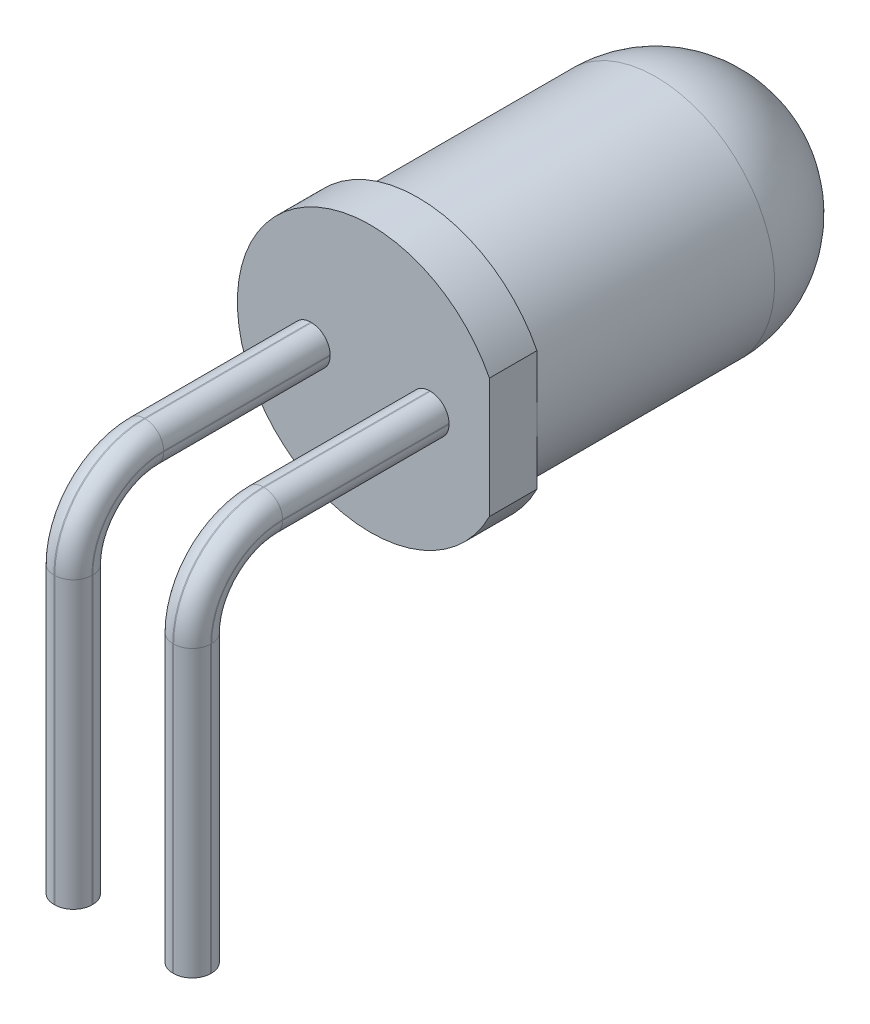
ISO-10303-21;
HEADER;
FILE_DESCRIPTION(('STEP AP214'),'2;1');
FILE_NAME('part.step','',(''),(''),'','','');
FILE_SCHEMA(('AUTOMOTIVE_DESIGN { 1 0 10303 214 1 1 1 1 }'));
ENDSEC;
DATA;
#1=APPLICATION_CONTEXT('core data for automotive mechanical design processes');
#2=APPLICATION_PROTOCOL_DEFINITION('international standard','automotive_design',2000,#1);
#3=PRODUCT_CONTEXT('',#1,'mechanical');
#4=PRODUCT('Part','Part','',(#3));
#5=PRODUCT_RELATED_PRODUCT_CATEGORY('part','',(#4));
#6=PRODUCT_DEFINITION_FORMATION('','',#4);
#7=PRODUCT_DEFINITION_CONTEXT('part definition',#1,'design');
#8=PRODUCT_DEFINITION('design','',#6,#7);
#9=PRODUCT_DEFINITION_SHAPE('','',#8);
#10=(LENGTH_UNIT() NAMED_UNIT(*) SI_UNIT(.MILLI.,.METRE.));
#11=(NAMED_UNIT(*) PLANE_ANGLE_UNIT() SI_UNIT($,.RADIAN.));
#12=(NAMED_UNIT(*) SI_UNIT($,.STERADIAN.) SOLID_ANGLE_UNIT());
#13=UNCERTAINTY_MEASURE_WITH_UNIT(LENGTH_MEASURE(1.E-05),#10,'distance_accuracy_value','');
#14=(GEOMETRIC_REPRESENTATION_CONTEXT(3) GLOBAL_UNCERTAINTY_ASSIGNED_CONTEXT((#13)) GLOBAL_UNIT_ASSIGNED_CONTEXT((#10,
#11,#12)) REPRESENTATION_CONTEXT('',''));
#15=CARTESIAN_POINT('',(0.,0.,0.));
#16=DIRECTION('',(0.,0.,1.));
#17=DIRECTION('',(1.,0.,0.));
#18=AXIS2_PLACEMENT_3D('',#15,#16,#17);
#19=CARTESIAN_POINT('',(1.65,-1.50000032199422,11.9999992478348));
#20=DIRECTION('',(-1.,0.,0.));
#21=DIRECTION('',(0.,0.,1.));
#22=AXIS2_PLACEMENT_3D('',#19,#20,#21);
#23=CYLINDRICAL_SURFACE('',#22,1.10000032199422);
#24=DIRECTION('',(-1.,0.,0.));
#25=VECTOR('',#24,1.);
#26=CARTESIAN_POINT('',(1.65,-0.399999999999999,11.9999993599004));
#27=LINE('',#26,#25);
#28=CARTESIAN_POINT('',(-1.24,-0.399999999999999,11.9999993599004));
#29=VERTEX_POINT('',#28);
#30=CARTESIAN_POINT('',(-1.26,-0.399999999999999,11.9999993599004));
#31=VERTEX_POINT('',#30);
#32=EDGE_CURVE('E489',#29,#31,#27,.T.);
#33=ORIENTED_EDGE('',*,*,#32,.F.);
#34=CARTESIAN_POINT('',(-1.24,-1.50000032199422,11.9999992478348));
#35=DIRECTION('',(1.,0.,0.));
#36=DIRECTION('',(0.,0.,-1.));
#37=AXIS2_PLACEMENT_3D('',#34,#35,#36);
#38=CIRCLE('',#37,1.10000032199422);
#39=CARTESIAN_POINT('',(-1.24,-1.50434905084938,13.0999909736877));
#40=VERTEX_POINT('',#39);
#41=EDGE_CURVE('E376',#29,#40,#38,.T.);
#42=ORIENTED_EDGE('',*,*,#41,.T.);
#43=DIRECTION('',(-1.,0.,0.));
#44=VECTOR('',#43,1.);
#45=CARTESIAN_POINT('',(1.65,-1.50434905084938,13.0999909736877));
#46=LINE('',#45,#44);
#47=CARTESIAN_POINT('',(-1.26,-1.50434905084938,13.0999909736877));
#48=VERTEX_POINT('',#47);
#49=EDGE_CURVE('E464',#40,#48,#46,.T.);
#50=ORIENTED_EDGE('',*,*,#49,.T.);
#51=CARTESIAN_POINT('',(-1.26,-1.50000032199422,11.9999992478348));
#52=DIRECTION('',(1.,0.,0.));
#53=DIRECTION('',(0.,0.,-1.));
#54=AXIS2_PLACEMENT_3D('',#51,#52,#53);
#55=CIRCLE('',#54,1.10000032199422);
#56=EDGE_CURVE('E374',#48,#31,#55,.F.);
#57=ORIENTED_EDGE('',*,*,#56,.T.);
#58=EDGE_LOOP('',(#33,#42,#50,#57));
#59=FACE_BOUND('',#58,.T.);
#60=ADVANCED_FACE('F26',(#59),#23,.F.);
#61=CARTESIAN_POINT('',(1.26,-1.50434905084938,13.0999909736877));
#62=VERTEX_POINT('',#61);
#63=CARTESIAN_POINT('',(1.24,-1.50434905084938,13.0999909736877));
#64=VERTEX_POINT('',#63);
#65=EDGE_CURVE('E468',#62,#64,#46,.T.);
#66=ORIENTED_EDGE('',*,*,#65,.T.);
#67=CARTESIAN_POINT('',(1.24,-1.50000032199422,11.9999992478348));
#68=DIRECTION('',(-1.,0.,0.));
#69=DIRECTION('',(0.,0.,1.));
#70=AXIS2_PLACEMENT_3D('',#67,#68,#69);
#71=CIRCLE('',#70,1.10000032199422);
#72=CARTESIAN_POINT('',(1.24,-0.399999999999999,11.9999993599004));
#73=VERTEX_POINT('',#72);
#74=EDGE_CURVE('E380',#64,#73,#71,.T.);
#75=ORIENTED_EDGE('',*,*,#74,.T.);
#76=CARTESIAN_POINT('',(1.26,-0.399999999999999,11.9999993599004));
#77=VERTEX_POINT('',#76);
#78=EDGE_CURVE('E258',#77,#73,#27,.T.);
#79=ORIENTED_EDGE('',*,*,#78,.F.);
#80=CARTESIAN_POINT('',(1.26,-1.50000032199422,11.9999992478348));
#81=DIRECTION('',(1.,0.,0.));
#82=DIRECTION('',(0.,0.,-1.));
#83=AXIS2_PLACEMENT_3D('',#80,#81,#82);
#84=CIRCLE('',#83,1.10000032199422);
#85=EDGE_CURVE('E378',#77,#62,#84,.T.);
#86=ORIENTED_EDGE('',*,*,#85,.T.);
#87=EDGE_LOOP('',(#66,#75,#79,#86));
#88=FACE_BOUND('',#87,.T.);
#89=ADVANCED_FACE('F619',(#88),#23,.F.);
#90=CARTESIAN_POINT('',(1.65,-0.4,8.4544798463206));
#91=DIRECTION('',(0.,1.,0.));
#92=DIRECTION('',(0.,0.,1.));
#93=AXIS2_PLACEMENT_3D('',#90,#91,#92);
#94=PLANE('',#93);
#95=DIRECTION('',(-1.,0.,0.));
#96=VECTOR('',#95,1.);
#97=CARTESIAN_POINT('',(0.,-0.4,8.5));
#98=LINE('',#97,#96);
#99=CARTESIAN_POINT('',(-1.24,-0.4,8.5));
#100=VERTEX_POINT('',#99);
#101=CARTESIAN_POINT('',(-1.26,-0.4,8.5));
#102=VERTEX_POINT('',#101);
#103=EDGE_CURVE('E296',#100,#102,#98,.T.);
#104=ORIENTED_EDGE('',*,*,#103,.F.);
#105=DIRECTION('',(0.,0.,-1.));
#106=VECTOR('',#105,1.);
#107=CARTESIAN_POINT('',(-1.24,-0.399999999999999,11.9999993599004));
#108=LINE('',#107,#106);
#109=EDGE_CURVE('E316',#100,#29,#108,.F.);
#110=ORIENTED_EDGE('',*,*,#109,.T.);
#111=ORIENTED_EDGE('',*,*,#32,.T.);
#112=DIRECTION('',(0.,0.,-1.));
#113=VECTOR('',#112,1.);
#114=CARTESIAN_POINT('',(-1.26,-0.4,8.4544798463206));
#115=LINE('',#114,#113);
#116=EDGE_CURVE('E313',#31,#102,#115,.T.);
#117=ORIENTED_EDGE('',*,*,#116,.T.);
#118=EDGE_LOOP('',(#104,#110,#111,#117));
#119=FACE_BOUND('',#118,.T.);
#120=ADVANCED_FACE('F499',(#119),#94,.F.);
#121=ORIENTED_EDGE('',*,*,#78,.T.);
#122=DIRECTION('',(0.,0.,1.));
#123=VECTOR('',#122,1.);
#124=CARTESIAN_POINT('',(1.24,-0.4,8.5));
#125=LINE('',#124,#123);
#126=CARTESIAN_POINT('',(1.24,-0.4,8.5));
#127=VERTEX_POINT('',#126);
#128=EDGE_CURVE('E346',#73,#127,#125,.F.);
#129=ORIENTED_EDGE('',*,*,#128,.T.);
#130=CARTESIAN_POINT('',(1.26,-0.4,8.5));
#131=VERTEX_POINT('',#130);
#132=EDGE_CURVE('E292',#131,#127,#98,.T.);
#133=ORIENTED_EDGE('',*,*,#132,.F.);
#134=DIRECTION('',(0.,0.,-1.));
#135=VECTOR('',#134,1.);
#136=CARTESIAN_POINT('',(1.26,-0.399999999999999,11.9999993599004));
#137=LINE('',#136,#135);
#138=EDGE_CURVE('E344',#131,#77,#137,.F.);
#139=ORIENTED_EDGE('',*,*,#138,.T.);
#140=EDGE_LOOP('',(#121,#129,#133,#139));
#141=FACE_BOUND('',#140,.T.);
#142=ADVANCED_FACE('F609',(#141),#94,.F.);
#143=CARTESIAN_POINT('',(1.65,0.4,8.4544798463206));
#144=DIRECTION('',(0.,-1.,0.));
#145=DIRECTION('',(0.,0.,-1.));
#146=AXIS2_PLACEMENT_3D('',#143,#144,#145);
#147=PLANE('',#146);
#148=DIRECTION('',(1.,0.,0.));
#149=VECTOR('',#148,1.);
#150=CARTESIAN_POINT('',(0.,0.400000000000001,8.5));
#151=LINE('',#150,#149);
#152=CARTESIAN_POINT('',(-1.26,0.400000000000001,8.5));
#153=VERTEX_POINT('',#152);
#154=CARTESIAN_POINT('',(-1.24,0.400000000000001,8.5));
#155=VERTEX_POINT('',#154);
#156=EDGE_CURVE('E291',#153,#155,#151,.T.);
#157=ORIENTED_EDGE('',*,*,#156,.F.);
#158=DIRECTION('',(0.,0.,1.));
#159=VECTOR('',#158,1.);
#160=CARTESIAN_POINT('',(-1.26,0.4,8.4544798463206));
#161=LINE('',#160,#159);
#162=CARTESIAN_POINT('',(-1.26,0.400000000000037,11.9999993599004));
#163=VERTEX_POINT('',#162);
#164=EDGE_CURVE('E384',#153,#163,#161,.T.);
#165=ORIENTED_EDGE('',*,*,#164,.T.);
#166=DIRECTION('',(-1.,0.,0.));
#167=VECTOR('',#166,1.);
#168=CARTESIAN_POINT('',(1.65,0.400000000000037,11.9999993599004));
#169=LINE('',#168,#167);
#170=CARTESIAN_POINT('',(-1.24,0.400000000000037,11.9999993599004));
#171=VERTEX_POINT('',#170);
#172=EDGE_CURVE('E485',#171,#163,#169,.T.);
#173=ORIENTED_EDGE('',*,*,#172,.F.);
#174=DIRECTION('',(0.,0.,1.));
#175=VECTOR('',#174,1.);
#176=CARTESIAN_POINT('',(-1.24,0.400000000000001,8.5));
#177=LINE('',#176,#175);
#178=EDGE_CURVE('E382',#171,#155,#177,.F.);
#179=ORIENTED_EDGE('',*,*,#178,.T.);
#180=EDGE_LOOP('',(#157,#165,#173,#179));
#181=FACE_BOUND('',#180,.T.);
#182=ADVANCED_FACE('F606',(#181),#147,.F.);
#183=CARTESIAN_POINT('',(1.24,0.400000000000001,8.5));
#184=VERTEX_POINT('',#183);
#185=CARTESIAN_POINT('',(1.26,0.400000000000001,8.5));
#186=VERTEX_POINT('',#185);
#187=EDGE_CURVE('E288',#184,#186,#151,.T.);
#188=ORIENTED_EDGE('',*,*,#187,.F.);
#189=DIRECTION('',(0.,0.,-1.));
#190=VECTOR('',#189,1.);
#191=CARTESIAN_POINT('',(1.24,0.400000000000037,11.9999993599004));
#192=LINE('',#191,#190);
#193=CARTESIAN_POINT('',(1.24,0.400000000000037,11.9999993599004));
#194=VERTEX_POINT('',#193);
#195=EDGE_CURVE('E393',#184,#194,#192,.F.);
#196=ORIENTED_EDGE('',*,*,#195,.T.);
#197=CARTESIAN_POINT('',(1.26,0.400000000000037,11.9999993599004));
#198=VERTEX_POINT('',#197);
#199=EDGE_CURVE('E487',#198,#194,#169,.T.);
#200=ORIENTED_EDGE('',*,*,#199,.F.);
#201=DIRECTION('',(0.,0.,1.));
#202=VECTOR('',#201,1.);
#203=CARTESIAN_POINT('',(1.26,0.400000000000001,8.5));
#204=LINE('',#203,#202);
#205=EDGE_CURVE('E391',#198,#186,#204,.F.);
#206=ORIENTED_EDGE('',*,*,#205,.T.);
#207=EDGE_LOOP('',(#188,#196,#200,#206));
#208=FACE_BOUND('',#207,.T.);
#209=ADVANCED_FACE('F608',(#208),#147,.F.);
#210=CARTESIAN_POINT('',(1.65,-1.50000032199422,11.9999992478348));
#211=DIRECTION('',(-1.,0.,0.));
#212=DIRECTION('',(0.,0.,1.));
#213=AXIS2_PLACEMENT_3D('',#210,#211,#212);
#214=CYLINDRICAL_SURFACE('',#213,1.90000032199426);
#215=ORIENTED_EDGE('',*,*,#172,.T.);
#216=CARTESIAN_POINT('',(-1.26,-1.50000032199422,11.9999992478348));
#217=DIRECTION('',(1.,0.,0.));
#218=DIRECTION('',(0.,0.,-1.));
#219=AXIS2_PLACEMENT_3D('',#216,#217,#218);
#220=CIRCLE('',#219,1.90000032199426);
#221=CARTESIAN_POINT('',(-1.26,-1.50289165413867,13.8999973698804));
#222=VERTEX_POINT('',#221);
#223=EDGE_CURVE('E389',#163,#222,#220,.T.);
#224=ORIENTED_EDGE('',*,*,#223,.T.);
#225=DIRECTION('',(-1.,0.,0.));
#226=VECTOR('',#225,1.);
#227=CARTESIAN_POINT('',(1.65,-1.50289165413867,13.8999973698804));
#228=LINE('',#227,#226);
#229=CARTESIAN_POINT('',(-1.24,-1.50289165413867,13.8999973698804));
#230=VERTEX_POINT('',#229);
#231=EDGE_CURVE('E486',#230,#222,#228,.T.);
#232=ORIENTED_EDGE('',*,*,#231,.F.);
#233=CARTESIAN_POINT('',(-1.24,-1.50000032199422,11.9999992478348));
#234=DIRECTION('',(1.,0.,0.));
#235=DIRECTION('',(0.,0.,-1.));
#236=AXIS2_PLACEMENT_3D('',#233,#234,#235);
#237=CIRCLE('',#236,1.90000032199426);
#238=EDGE_CURVE('E387',#230,#171,#237,.F.);
#239=ORIENTED_EDGE('',*,*,#238,.T.);
#240=EDGE_LOOP('',(#215,#224,#232,#239));
#241=FACE_BOUND('',#240,.T.);
#242=ADVANCED_FACE('F604',(#241),#214,.T.);
#243=ORIENTED_EDGE('',*,*,#199,.T.);
#244=CARTESIAN_POINT('',(1.24,-1.50000032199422,11.9999992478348));
#245=DIRECTION('',(-1.,0.,0.));
#246=DIRECTION('',(0.,0.,1.));
#247=AXIS2_PLACEMENT_3D('',#244,#245,#246);
#248=CIRCLE('',#247,1.90000032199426);
#249=CARTESIAN_POINT('',(1.24,-1.50289165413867,13.8999973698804));
#250=VERTEX_POINT('',#249);
#251=EDGE_CURVE('E397',#194,#250,#248,.F.);
#252=ORIENTED_EDGE('',*,*,#251,.T.);
#253=CARTESIAN_POINT('',(1.26,-1.50289165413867,13.8999973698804));
#254=VERTEX_POINT('',#253);
#255=EDGE_CURVE('E482',#254,#250,#228,.T.);
#256=ORIENTED_EDGE('',*,*,#255,.F.);
#257=CARTESIAN_POINT('',(1.26,-1.50000032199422,11.9999992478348));
#258=DIRECTION('',(1.,0.,0.));
#259=DIRECTION('',(0.,0.,-1.));
#260=AXIS2_PLACEMENT_3D('',#257,#258,#259);
#261=CIRCLE('',#260,1.90000032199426);
#262=EDGE_CURVE('E395',#254,#198,#261,.F.);
#263=ORIENTED_EDGE('',*,*,#262,.T.);
#264=EDGE_LOOP('',(#243,#252,#256,#263));
#265=FACE_BOUND('',#264,.T.);
#266=ADVANCED_FACE('F853',(#265),#214,.T.);
#267=CARTESIAN_POINT('',(1.65,-7.50434905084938,13.8999973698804));
#268=DIRECTION('',(0.,0.,-1.));
#269=DIRECTION('',(-1.,0.,0.));
#270=AXIS2_PLACEMENT_3D('',#267,#268,#269);
#271=PLANE('',#270);
#272=ORIENTED_EDGE('',*,*,#231,.T.);
#273=DIRECTION('',(0.,-1.,0.));
#274=VECTOR('',#273,1.);
#275=CARTESIAN_POINT('',(-1.26,-7.50434905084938,13.8999973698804));
#276=LINE('',#275,#274);
#277=CARTESIAN_POINT('',(-1.26,-7.50434905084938,13.8999973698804));
#278=VERTEX_POINT('',#277);
#279=EDGE_CURVE('E41',#222,#278,#276,.T.);
#280=ORIENTED_EDGE('',*,*,#279,.T.);
#281=DIRECTION('',(-1.,0.,0.));
#282=VECTOR('',#281,1.);
#283=CARTESIAN_POINT('',(1.65,-7.50434905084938,13.8999973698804));
#284=LINE('',#283,#282);
#285=CARTESIAN_POINT('',(-1.24,-7.50434905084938,13.8999973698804));
#286=VERTEX_POINT('',#285);
#287=EDGE_CURVE('E479',#286,#278,#284,.T.);
#288=ORIENTED_EDGE('',*,*,#287,.F.);
#289=DIRECTION('',(0.,-1.,0.));
#290=VECTOR('',#289,1.);
#291=CARTESIAN_POINT('',(-1.24,-1.50289165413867,13.8999973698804));
#292=LINE('',#291,#290);
#293=EDGE_CURVE('E414',#286,#230,#292,.F.);
#294=ORIENTED_EDGE('',*,*,#293,.T.);
#295=EDGE_LOOP('',(#272,#280,#288,#294));
#296=FACE_BOUND('',#295,.T.);
#297=ADVANCED_FACE('F851',(#296),#271,.F.);
#298=CARTESIAN_POINT('',(1.26,-7.50434905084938,13.8999973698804));
#299=VERTEX_POINT('',#298);
#300=CARTESIAN_POINT('',(1.24,-7.50434905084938,13.8999973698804));
#301=VERTEX_POINT('',#300);
#302=EDGE_CURVE('E481',#299,#301,#284,.T.);
#303=ORIENTED_EDGE('',*,*,#302,.F.);
#304=DIRECTION('',(0.,-1.,0.));
#305=VECTOR('',#304,1.);
#306=CARTESIAN_POINT('',(1.26,-1.50289165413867,13.8999973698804));
#307=LINE('',#306,#305);
#308=EDGE_CURVE('E401',#299,#254,#307,.F.);
#309=ORIENTED_EDGE('',*,*,#308,.T.);
#310=ORIENTED_EDGE('',*,*,#255,.T.);
#311=DIRECTION('',(0.,1.,0.));
#312=VECTOR('',#311,1.);
#313=CARTESIAN_POINT('',(1.24,-7.50434905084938,13.8999973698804));
#314=LINE('',#313,#312);
#315=EDGE_CURVE('E399',#250,#301,#314,.F.);
#316=ORIENTED_EDGE('',*,*,#315,.T.);
#317=EDGE_LOOP('',(#303,#309,#310,#316));
#318=FACE_BOUND('',#317,.T.);
#319=ADVANCED_FACE('F850',(#318),#271,.F.);
#320=CARTESIAN_POINT('',(1.65,-7.50434905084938,13.0999909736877));
#321=DIRECTION('',(0.,1.,0.));
#322=DIRECTION('',(0.,0.,1.));
#323=AXIS2_PLACEMENT_3D('',#320,#321,#322);
#324=PLANE('',#323);
#325=DIRECTION('',(-1.,0.,0.));
#326=VECTOR('',#325,1.);
#327=CARTESIAN_POINT('',(1.65,-7.50434905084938,13.0999909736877));
#328=LINE('',#327,#326);
#329=CARTESIAN_POINT('',(-1.24,-7.50434905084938,13.0999909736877));
#330=VERTEX_POINT('',#329);
#331=CARTESIAN_POINT('',(-1.26,-7.50434905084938,13.0999909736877));
#332=VERTEX_POINT('',#331);
#333=EDGE_CURVE('E475',#330,#332,#328,.T.);
#334=ORIENTED_EDGE('',*,*,#333,.F.);
#335=CARTESIAN_POINT('',(-1.24,-7.50434905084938,13.4899909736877));
#336=DIRECTION('',(0.,1.,0.));
#337=DIRECTION('',(0.,0.,1.));
#338=AXIS2_PLACEMENT_3D('',#335,#336,#337);
#339=CIRCLE('',#338,0.39);
#340=CARTESIAN_POINT('',(-0.85,-7.50434905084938,13.4899909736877));
#341=VERTEX_POINT('',#340);
#342=EDGE_CURVE('E412',#330,#341,#339,.F.);
#343=ORIENTED_EDGE('',*,*,#342,.T.);
#344=DIRECTION('',(0.,0.,-1.));
#345=VECTOR('',#344,1.);
#346=CARTESIAN_POINT('',(-0.85,-7.50434905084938,13.0999909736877));
#347=LINE('',#346,#345);
#348=CARTESIAN_POINT('',(-0.85,-7.50434905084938,13.5099973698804));
#349=VERTEX_POINT('',#348);
#350=EDGE_CURVE('E471',#349,#341,#347,.T.);
#351=ORIENTED_EDGE('',*,*,#350,.F.);
#352=CARTESIAN_POINT('',(-1.24,-7.50434905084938,13.5099973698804));
#353=DIRECTION('',(0.,1.,0.));
#354=DIRECTION('',(0.,0.,1.));
#355=AXIS2_PLACEMENT_3D('',#352,#353,#354);
#356=CIRCLE('',#355,0.39);
#357=EDGE_CURVE('E48',#349,#286,#356,.F.);
#358=ORIENTED_EDGE('',*,*,#357,.T.);
#359=ORIENTED_EDGE('',*,*,#287,.T.);
#360=CARTESIAN_POINT('',(-1.26,-7.50434905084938,13.5099973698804));
#361=DIRECTION('',(0.,1.,0.));
#362=DIRECTION('',(0.,0.,1.));
#363=AXIS2_PLACEMENT_3D('',#360,#361,#362);
#364=CIRCLE('',#363,0.39);
#365=CARTESIAN_POINT('',(-1.65,-7.50434905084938,13.5099973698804));
#366=VERTEX_POINT('',#365);
#367=EDGE_CURVE('E408',#278,#366,#364,.F.);
#368=ORIENTED_EDGE('',*,*,#367,.T.);
#369=DIRECTION('',(0.,0.,-1.));
#370=VECTOR('',#369,1.);
#371=CARTESIAN_POINT('',(-1.65,-7.50434905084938,13.0999909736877));
#372=LINE('',#371,#370);
#373=CARTESIAN_POINT('',(-1.65,-7.50434905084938,13.4899909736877));
#374=VERTEX_POINT('',#373);
#375=EDGE_CURVE('E465',#366,#374,#372,.T.);
#376=ORIENTED_EDGE('',*,*,#375,.T.);
#377=CARTESIAN_POINT('',(-1.26,-7.50434905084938,13.4899909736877));
#378=DIRECTION('',(0.,1.,0.));
#379=DIRECTION('',(0.,0.,1.));
#380=AXIS2_PLACEMENT_3D('',#377,#378,#379);
#381=CIRCLE('',#380,0.39);
#382=EDGE_CURVE('E410',#374,#332,#381,.F.);
#383=ORIENTED_EDGE('',*,*,#382,.T.);
#384=EDGE_LOOP('',(#334,#343,#351,#358,#359,#368,#376,#383));
#385=FACE_BOUND('',#384,.T.);
#386=ADVANCED_FACE('F847',(#385),#324,.F.);
#387=CARTESIAN_POINT('',(1.26,-7.50434905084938,13.0999909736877));
#388=VERTEX_POINT('',#387);
#389=CARTESIAN_POINT('',(1.24,-7.50434905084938,13.0999909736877));
#390=VERTEX_POINT('',#389);
#391=EDGE_CURVE('E478',#388,#390,#328,.T.);
#392=ORIENTED_EDGE('',*,*,#391,.F.);
#393=CARTESIAN_POINT('',(1.26,-7.50434905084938,13.4899909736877));
#394=DIRECTION('',(0.,1.,0.));
#395=DIRECTION('',(0.,0.,1.));
#396=AXIS2_PLACEMENT_3D('',#393,#394,#395);
#397=CIRCLE('',#396,0.39);
#398=CARTESIAN_POINT('',(1.65,-7.50434905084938,13.4899909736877));
#399=VERTEX_POINT('',#398);
#400=EDGE_CURVE('E372',#388,#399,#397,.F.);
#401=ORIENTED_EDGE('',*,*,#400,.T.);
#402=DIRECTION('',(0.,0.,-1.));
#403=VECTOR('',#402,1.);
#404=CARTESIAN_POINT('',(1.65,-7.50434905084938,13.0999909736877));
#405=LINE('',#404,#403);
#406=CARTESIAN_POINT('',(1.65,-7.50434905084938,13.5099973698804));
#407=VERTEX_POINT('',#406);
#408=EDGE_CURVE('E455',#407,#399,#405,.T.);
#409=ORIENTED_EDGE('',*,*,#408,.F.);
#410=CARTESIAN_POINT('',(1.26,-7.50434905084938,13.5099973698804));
#411=DIRECTION('',(0.,1.,0.));
#412=DIRECTION('',(0.,0.,1.));
#413=AXIS2_PLACEMENT_3D('',#410,#411,#412);
#414=CIRCLE('',#413,0.39);
#415=EDGE_CURVE('E370',#407,#299,#414,.F.);
#416=ORIENTED_EDGE('',*,*,#415,.T.);
#417=ORIENTED_EDGE('',*,*,#302,.T.);
#418=CARTESIAN_POINT('',(1.24,-7.50434905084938,13.5099973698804));
#419=DIRECTION('',(0.,1.,0.));
#420=DIRECTION('',(0.,0.,1.));
#421=AXIS2_PLACEMENT_3D('',#418,#419,#420);
#422=CIRCLE('',#421,0.39);
#423=CARTESIAN_POINT('',(0.85,-7.50434905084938,13.5099973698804));
#424=VERTEX_POINT('',#423);
#425=EDGE_CURVE('E366',#301,#424,#422,.F.);
#426=ORIENTED_EDGE('',*,*,#425,.T.);
#427=DIRECTION('',(0.,0.,1.));
#428=VECTOR('',#427,1.);
#429=CARTESIAN_POINT('',(0.85,-7.50434905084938,13.0999909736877));
#430=LINE('',#429,#428);
#431=CARTESIAN_POINT('',(0.85,-7.50434905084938,13.4899909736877));
#432=VERTEX_POINT('',#431);
#433=EDGE_CURVE('E566',#432,#424,#430,.T.);
#434=ORIENTED_EDGE('',*,*,#433,.F.);
#435=CARTESIAN_POINT('',(1.24,-7.50434905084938,13.4899909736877));
#436=DIRECTION('',(0.,1.,0.));
#437=DIRECTION('',(0.,0.,1.));
#438=AXIS2_PLACEMENT_3D('',#435,#436,#437);
#439=CIRCLE('',#438,0.39);
#440=EDGE_CURVE('E368',#432,#390,#439,.F.);
#441=ORIENTED_EDGE('',*,*,#440,.T.);
#442=EDGE_LOOP('',(#392,#401,#409,#416,#417,#426,#434,#441));
#443=FACE_BOUND('',#442,.T.);
#444=ADVANCED_FACE('F460',(#443),#324,.F.);
#445=CARTESIAN_POINT('',(1.65,-1.50434905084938,13.0999909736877));
#446=DIRECTION('',(0.,0.,1.));
#447=DIRECTION('',(1.,0.,0.));
#448=AXIS2_PLACEMENT_3D('',#445,#446,#447);
#449=PLANE('',#448);
#450=ORIENTED_EDGE('',*,*,#49,.F.);
#451=DIRECTION('',(0.,1.,0.));
#452=VECTOR('',#451,1.);
#453=CARTESIAN_POINT('',(-1.24,-7.50434905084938,13.0999909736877));
#454=LINE('',#453,#452);
#455=EDGE_CURVE('E405',#40,#330,#454,.F.);
#456=ORIENTED_EDGE('',*,*,#455,.T.);
#457=ORIENTED_EDGE('',*,*,#333,.T.);
#458=DIRECTION('',(0.,1.,0.));
#459=VECTOR('',#458,1.);
#460=CARTESIAN_POINT('',(-1.26,-1.50434905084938,13.0999909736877));
#461=LINE('',#460,#459);
#462=EDGE_CURVE('E403',#332,#48,#461,.T.);
#463=ORIENTED_EDGE('',*,*,#462,.T.);
#464=EDGE_LOOP('',(#450,#456,#457,#463));
#465=FACE_BOUND('',#464,.T.);
#466=ADVANCED_FACE('F844',(#465),#449,.F.);
#467=ORIENTED_EDGE('',*,*,#65,.F.);
#468=DIRECTION('',(0.,1.,0.));
#469=VECTOR('',#468,1.);
#470=CARTESIAN_POINT('',(1.26,-7.50434905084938,13.0999909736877));
#471=LINE('',#470,#469);
#472=EDGE_CURVE('E364',#62,#388,#471,.F.);
#473=ORIENTED_EDGE('',*,*,#472,.T.);
#474=ORIENTED_EDGE('',*,*,#391,.T.);
#475=DIRECTION('',(0.,-1.,0.));
#476=VECTOR('',#475,1.);
#477=CARTESIAN_POINT('',(1.24,-1.50434905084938,13.0999909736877));
#478=LINE('',#477,#476);
#479=EDGE_CURVE('E362',#390,#64,#478,.F.);
#480=ORIENTED_EDGE('',*,*,#479,.T.);
#481=EDGE_LOOP('',(#467,#473,#474,#480));
#482=FACE_BOUND('',#481,.T.);
#483=ADVANCED_FACE('F646',(#482),#449,.F.);
#484=CARTESIAN_POINT('',(0.,0.,8.5));
#485=DIRECTION('',(0.,0.,-1.));
#486=DIRECTION('',(-1.,0.,0.));
#487=AXIS2_PLACEMENT_3D('',#484,#485,#486);
#488=CYLINDRICAL_SURFACE('',#487,2.5);
#489=CARTESIAN_POINT('',(0.,0.,2.5));
#490=DIRECTION('',(0.,0.,-1.));
#491=DIRECTION('',(-1.,0.,0.));
#492=AXIS2_PLACEMENT_3D('',#489,#490,#491);
#493=CIRCLE('',#492,2.5);
#494=CARTESIAN_POINT('',(-2.5,0.,2.5));
#495=VERTEX_POINT('',#494);
#496=EDGE_CURVE('E282',#495,#495,#493,.F.);
#497=ORIENTED_EDGE('',*,*,#496,.T.);
#498=EDGE_LOOP('',(#497));
#499=FACE_BOUND('',#498,.T.);
#500=CARTESIAN_POINT('',(0.,0.,7.5));
#501=DIRECTION('',(0.,0.,1.));
#502=DIRECTION('',(1.,0.,0.));
#503=AXIS2_PLACEMENT_3D('',#500,#501,#502);
#504=CIRCLE('',#503,2.5);
#505=CARTESIAN_POINT('',(2.5,0.,7.5));
#506=VERTEX_POINT('',#505);
#507=EDGE_CURVE('E278',#506,#506,#504,.T.);
#508=ORIENTED_EDGE('',*,*,#507,.F.);
#509=EDGE_LOOP('',(#508));
#510=FACE_BOUND('',#509,.T.);
#511=ADVANCED_FACE('F28',(#499,#510),#488,.T.);
#512=CARTESIAN_POINT('',(0.,0.,7.5));
#513=DIRECTION('',(0.,0.,1.));
#514=DIRECTION('',(1.,0.,0.));
#515=AXIS2_PLACEMENT_3D('',#512,#513,#514);
#516=PLANE('',#515);
#517=DIRECTION('',(0.,1.,0.));
#518=VECTOR('',#517,1.);
#519=CARTESIAN_POINT('',(2.5,1.26095202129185,7.5));
#520=LINE('',#519,#518);
#521=CARTESIAN_POINT('',(2.5,1.26095202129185,7.5));
#522=VERTEX_POINT('',#521);
#523=EDGE_CURVE('E273',#506,#522,#520,.T.);
#524=ORIENTED_EDGE('',*,*,#523,.F.);
#525=ORIENTED_EDGE('',*,*,#507,.T.);
#526=CARTESIAN_POINT('',(2.5,-1.26095202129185,7.5));
#527=VERTEX_POINT('',#526);
#528=EDGE_CURVE('E269',#527,#506,#520,.T.);
#529=ORIENTED_EDGE('',*,*,#528,.F.);
#530=CARTESIAN_POINT('',(0.,0.,7.5));
#531=DIRECTION('',(0.,0.,1.));
#532=DIRECTION('',(1.,0.,0.));
#533=AXIS2_PLACEMENT_3D('',#530,#531,#532);
#534=CIRCLE('',#533,2.8);
#535=EDGE_CURVE('E264',#522,#527,#534,.T.);
#536=ORIENTED_EDGE('',*,*,#535,.F.);
#537=EDGE_LOOP('',(#524,#525,#529,#536));
#538=FACE_BOUND('',#537,.T.);
#539=ADVANCED_FACE('F631',(#538),#516,.F.);
#540=CARTESIAN_POINT('',(2.5,1.26095202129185,7.5));
#541=DIRECTION('',(1.,0.,0.));
#542=DIRECTION('',(0.,0.,-1.));
#543=AXIS2_PLACEMENT_3D('',#540,#541,#542);
#544=PLANE('',#543);
#545=ORIENTED_EDGE('',*,*,#528,.T.);
#546=ORIENTED_EDGE('',*,*,#523,.T.);
#547=DIRECTION('',(0.,0.,1.));
#548=VECTOR('',#547,1.);
#549=CARTESIAN_POINT('',(2.5,1.26095202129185,7.5));
#550=LINE('',#549,#548);
#551=CARTESIAN_POINT('',(2.5,1.26095202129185,8.5));
#552=VERTEX_POINT('',#551);
#553=EDGE_CURVE('E268',#522,#552,#550,.T.);
#554=ORIENTED_EDGE('',*,*,#553,.T.);
#555=DIRECTION('',(0.,1.,0.));
#556=VECTOR('',#555,1.);
#557=CARTESIAN_POINT('',(2.5,1.26095202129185,8.5));
#558=LINE('',#557,#556);
#559=CARTESIAN_POINT('',(2.5,-1.26095202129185,8.5));
#560=VERTEX_POINT('',#559);
#561=EDGE_CURVE('E254',#560,#552,#558,.T.);
#562=ORIENTED_EDGE('',*,*,#561,.F.);
#563=DIRECTION('',(0.,0.,1.));
#564=VECTOR('',#563,1.);
#565=CARTESIAN_POINT('',(2.5,-1.26095202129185,7.5));
#566=LINE('',#565,#564);
#567=EDGE_CURVE('E261',#527,#560,#566,.T.);
#568=ORIENTED_EDGE('',*,*,#567,.F.);
#569=EDGE_LOOP('',(#545,#546,#554,#562,#568));
#570=FACE_BOUND('',#569,.T.);
#571=ADVANCED_FACE('F271',(#570),#544,.T.);
#572=CARTESIAN_POINT('',(0.,0.,7.5));
#573=DIRECTION('',(0.,0.,1.));
#574=DIRECTION('',(1.,0.,0.));
#575=AXIS2_PLACEMENT_3D('',#572,#573,#574);
#576=CYLINDRICAL_SURFACE('',#575,2.8);
#577=CARTESIAN_POINT('',(0.,0.,8.5));
#578=DIRECTION('',(0.,0.,1.));
#579=DIRECTION('',(1.,0.,0.));
#580=AXIS2_PLACEMENT_3D('',#577,#578,#579);
#581=CIRCLE('',#580,2.8);
#582=EDGE_CURVE('E250',#552,#560,#581,.T.);
#583=ORIENTED_EDGE('',*,*,#582,.F.);
#584=ORIENTED_EDGE('',*,*,#553,.F.);
#585=ORIENTED_EDGE('',*,*,#535,.T.);
#586=ORIENTED_EDGE('',*,*,#567,.T.);
#587=EDGE_LOOP('',(#583,#584,#585,#586));
#588=FACE_BOUND('',#587,.T.);
#589=ADVANCED_FACE('F262',(#588),#576,.T.);
#590=CARTESIAN_POINT('',(0.,0.,8.5));
#591=DIRECTION('',(0.,0.,1.));
#592=DIRECTION('',(1.,0.,0.));
#593=AXIS2_PLACEMENT_3D('',#590,#591,#592);
#594=PLANE('',#593);
#595=ORIENTED_EDGE('',*,*,#156,.T.);
#596=CARTESIAN_POINT('',(-1.24,0.0100000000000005,8.5));
#597=DIRECTION('',(0.,0.,1.));
#598=DIRECTION('',(1.,0.,0.));
#599=AXIS2_PLACEMENT_3D('',#596,#597,#598);
#600=CIRCLE('',#599,0.39);
#601=CARTESIAN_POINT('',(-0.85,0.0100000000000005,8.5));
#602=VERTEX_POINT('',#601);
#603=EDGE_CURVE('E425',#155,#602,#600,.F.);
#604=ORIENTED_EDGE('',*,*,#603,.T.);
#605=DIRECTION('',(0.,-1.,0.));
#606=VECTOR('',#605,1.);
#607=CARTESIAN_POINT('',(-0.85,0.623900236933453,8.5));
#608=LINE('',#607,#606);
#609=CARTESIAN_POINT('',(-0.85,-0.01,8.5));
#610=VERTEX_POINT('',#609);
#611=EDGE_CURVE('E560',#602,#610,#608,.T.);
#612=ORIENTED_EDGE('',*,*,#611,.T.);
#613=CARTESIAN_POINT('',(-1.24,-0.0100000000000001,8.5));
#614=DIRECTION('',(0.,0.,1.));
#615=DIRECTION('',(1.,0.,0.));
#616=AXIS2_PLACEMENT_3D('',#613,#614,#615);
#617=CIRCLE('',#616,0.39);
#618=EDGE_CURVE('E417',#610,#100,#617,.F.);
#619=ORIENTED_EDGE('',*,*,#618,.T.);
#620=ORIENTED_EDGE('',*,*,#103,.T.);
#621=CARTESIAN_POINT('',(-1.26,-0.01,8.5));
#622=DIRECTION('',(0.,0.,1.));
#623=DIRECTION('',(1.,0.,0.));
#624=AXIS2_PLACEMENT_3D('',#621,#622,#623);
#625=CIRCLE('',#624,0.39);
#626=CARTESIAN_POINT('',(-1.65,-0.01,8.5));
#627=VERTEX_POINT('',#626);
#628=EDGE_CURVE('E419',#102,#627,#625,.F.);
#629=ORIENTED_EDGE('',*,*,#628,.T.);
#630=DIRECTION('',(0.,1.,0.));
#631=VECTOR('',#630,1.);
#632=CARTESIAN_POINT('',(-1.65,0.,8.5));
#633=LINE('',#632,#631);
#634=CARTESIAN_POINT('',(-1.65,0.0100000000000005,8.5));
#635=VERTEX_POINT('',#634);
#636=EDGE_CURVE('E285',#627,#635,#633,.T.);
#637=ORIENTED_EDGE('',*,*,#636,.T.);
#638=CARTESIAN_POINT('',(-1.26,0.0100000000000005,8.5));
#639=DIRECTION('',(0.,0.,1.));
#640=DIRECTION('',(1.,0.,0.));
#641=AXIS2_PLACEMENT_3D('',#638,#639,#640);
#642=CIRCLE('',#641,0.39);
#643=EDGE_CURVE('E423',#635,#153,#642,.F.);
#644=ORIENTED_EDGE('',*,*,#643,.T.);
#645=EDGE_LOOP('',(#595,#604,#612,#619,#620,#629,#637,#644));
#646=FACE_BOUND('',#645,.T.);
#647=ORIENTED_EDGE('',*,*,#132,.T.);
#648=CARTESIAN_POINT('',(1.24,-0.0100000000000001,8.5));
#649=DIRECTION('',(0.,0.,1.));
#650=DIRECTION('',(1.,0.,0.));
#651=AXIS2_PLACEMENT_3D('',#648,#649,#650);
#652=CIRCLE('',#651,0.39);
#653=CARTESIAN_POINT('',(0.85,-0.01,8.5));
#654=VERTEX_POINT('',#653);
#655=EDGE_CURVE('E421',#127,#654,#652,.F.);
#656=ORIENTED_EDGE('',*,*,#655,.T.);
#657=DIRECTION('',(0.,1.,0.));
#658=VECTOR('',#657,1.);
#659=CARTESIAN_POINT('',(0.85,0.623900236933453,8.5));
#660=LINE('',#659,#658);
#661=CARTESIAN_POINT('',(0.85,0.0100000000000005,8.5));
#662=VERTEX_POINT('',#661);
#663=EDGE_CURVE('E563',#654,#662,#660,.T.);
#664=ORIENTED_EDGE('',*,*,#663,.T.);
#665=CARTESIAN_POINT('',(1.24,0.0100000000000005,8.5));
#666=DIRECTION('',(0.,0.,1.));
#667=DIRECTION('',(1.,0.,0.));
#668=AXIS2_PLACEMENT_3D('',#665,#666,#667);
#669=CIRCLE('',#668,0.39);
#670=EDGE_CURVE('E427',#662,#184,#669,.F.);
#671=ORIENTED_EDGE('',*,*,#670,.T.);
#672=ORIENTED_EDGE('',*,*,#187,.T.);
#673=CARTESIAN_POINT('',(1.26,0.0100000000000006,8.5));
#674=DIRECTION('',(0.,0.,1.));
#675=DIRECTION('',(1.,0.,0.));
#676=AXIS2_PLACEMENT_3D('',#673,#674,#675);
#677=CIRCLE('',#676,0.39);
#678=CARTESIAN_POINT('',(1.65,0.0100000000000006,8.5));
#679=VERTEX_POINT('',#678);
#680=EDGE_CURVE('E34',#186,#679,#677,.F.);
#681=ORIENTED_EDGE('',*,*,#680,.T.);
#682=DIRECTION('',(0.,1.,0.));
#683=VECTOR('',#682,1.);
#684=CARTESIAN_POINT('',(1.65,0.,8.5));
#685=LINE('',#684,#683);
#686=CARTESIAN_POINT('',(1.65,-0.0100000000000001,8.5));
#687=VERTEX_POINT('',#686);
#688=EDGE_CURVE('E295',#687,#679,#685,.T.);
#689=ORIENTED_EDGE('',*,*,#688,.F.);
#690=CARTESIAN_POINT('',(1.26,-0.0100000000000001,8.5));
#691=DIRECTION('',(0.,0.,1.));
#692=DIRECTION('',(1.,0.,0.));
#693=AXIS2_PLACEMENT_3D('',#690,#691,#692);
#694=CIRCLE('',#693,0.39);
#695=EDGE_CURVE('E11',#687,#131,#694,.F.);
#696=ORIENTED_EDGE('',*,*,#695,.T.);
#697=EDGE_LOOP('',(#647,#656,#664,#671,#672,#681,#689,#696));
#698=FACE_BOUND('',#697,.T.);
#699=ORIENTED_EDGE('',*,*,#582,.T.);
#700=ORIENTED_EDGE('',*,*,#561,.T.);
#701=EDGE_LOOP('',(#699,#700));
#702=FACE_BOUND('',#701,.T.);
#703=ADVANCED_FACE('F252',(#646,#698,#702),#594,.T.);
#704=CARTESIAN_POINT('',(0.,0.,2.5));
#705=DIRECTION('',(0.,0.,1.));
#706=DIRECTION('',(1.,0.,0.));
#707=AXIS2_PLACEMENT_3D('',#704,#705,#706);
#708=SPHERICAL_SURFACE('',#707,2.5);
#709=ORIENTED_EDGE('',*,*,#496,.F.);
#710=EDGE_LOOP('',(#709));
#711=FACE_BOUND('',#710,.T.);
#712=ADVANCED_FACE('F627',(#711),#708,.T.);
#713=CARTESIAN_POINT('',(1.65,-1.50000032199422,11.9999992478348));
#714=DIRECTION('',(1.,0.,0.));
#715=DIRECTION('',(0.,0.,-1.));
#716=AXIS2_PLACEMENT_3D('',#713,#714,#715);
#717=PLANE('',#716);
#718=CARTESIAN_POINT('',(1.65,-1.50000032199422,11.9999992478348));
#719=DIRECTION('',(1.,0.,0.));
#720=DIRECTION('',(0.,0.,-1.));
#721=AXIS2_PLACEMENT_3D('',#718,#719,#720);
#722=CIRCLE('',#721,1.51000032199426);
#723=CARTESIAN_POINT('',(1.65,0.0100000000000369,11.9999993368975));
#724=VERTEX_POINT('',#723);
#725=CARTESIAN_POINT('',(1.65,-1.50289165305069,13.509996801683));
#726=VERTEX_POINT('',#725);
#727=EDGE_CURVE('E357',#724,#726,#722,.T.);
#728=ORIENTED_EDGE('',*,*,#727,.T.);
#729=DIRECTION('',(0.,-1.,0.));
#730=VECTOR('',#729,1.);
#731=CARTESIAN_POINT('',(1.65,-7.50434905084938,13.5099973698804));
#732=LINE('',#731,#730);
#733=EDGE_CURVE('E359',#726,#407,#732,.T.);
#734=ORIENTED_EDGE('',*,*,#733,.T.);
#735=ORIENTED_EDGE('',*,*,#408,.T.);
#736=DIRECTION('',(0.,1.,0.));
#737=VECTOR('',#736,1.);
#738=CARTESIAN_POINT('',(1.65,-1.50434905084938,13.4899909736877));
#739=LINE('',#738,#737);
#740=CARTESIAN_POINT('',(1.65,-1.50434905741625,13.4899932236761));
#741=VERTEX_POINT('',#740);
#742=EDGE_CURVE('E352',#399,#741,#739,.T.);
#743=ORIENTED_EDGE('',*,*,#742,.T.);
#744=CARTESIAN_POINT('',(1.65,-1.50000032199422,11.9999992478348));
#745=DIRECTION('',(1.,0.,0.));
#746=DIRECTION('',(0.,0.,-1.));
#747=AXIS2_PLACEMENT_3D('',#744,#745,#746);
#748=CIRCLE('',#747,1.49000032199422);
#749=CARTESIAN_POINT('',(1.65,-0.00999999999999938,11.9999993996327));
#750=VERTEX_POINT('',#749);
#751=EDGE_CURVE('E350',#741,#750,#748,.F.);
#752=ORIENTED_EDGE('',*,*,#751,.T.);
#753=DIRECTION('',(0.,0.,-1.));
#754=VECTOR('',#753,1.);
#755=CARTESIAN_POINT('',(1.65,-0.0100000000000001,8.5));
#756=LINE('',#755,#754);
#757=EDGE_CURVE('E348',#750,#687,#756,.T.);
#758=ORIENTED_EDGE('',*,*,#757,.T.);
#759=ORIENTED_EDGE('',*,*,#688,.T.);
#760=DIRECTION('',(0.,0.,1.));
#761=VECTOR('',#760,1.);
#762=CARTESIAN_POINT('',(1.65,0.0100000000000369,11.9999993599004));
#763=LINE('',#762,#761);
#764=EDGE_CURVE('E355',#679,#724,#763,.T.);
#765=ORIENTED_EDGE('',*,*,#764,.T.);
#766=EDGE_LOOP('',(#728,#734,#735,#743,#752,#758,#759,#765));
#767=FACE_BOUND('',#766,.T.);
#768=ADVANCED_FACE('F437',(#767),#717,.T.);
#769=CARTESIAN_POINT('',(-1.65,-1.50000032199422,11.9999992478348));
#770=DIRECTION('',(1.,0.,0.));
#771=DIRECTION('',(0.,0.,-1.));
#772=AXIS2_PLACEMENT_3D('',#769,#770,#771);
#773=PLANE('',#772);
#774=ORIENTED_EDGE('',*,*,#636,.F.);
#775=DIRECTION('',(0.,0.,-1.));
#776=VECTOR('',#775,1.);
#777=CARTESIAN_POINT('',(-1.65,-0.00999999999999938,11.9999992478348));
#778=LINE('',#777,#776);
#779=CARTESIAN_POINT('',(-1.65,-0.00999999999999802,11.9999993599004));
#780=VERTEX_POINT('',#779);
#781=EDGE_CURVE('E328',#627,#780,#778,.F.);
#782=ORIENTED_EDGE('',*,*,#781,.T.);
#783=CARTESIAN_POINT('',(-1.65,-1.50000032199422,11.9999992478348));
#784=DIRECTION('',(1.,0.,0.));
#785=DIRECTION('',(0.,0.,-1.));
#786=AXIS2_PLACEMENT_3D('',#783,#784,#785);
#787=CIRCLE('',#786,1.49000032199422);
#788=CARTESIAN_POINT('',(-1.65,-1.5058908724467,13.4899909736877));
#789=VERTEX_POINT('',#788);
#790=EDGE_CURVE('E326',#780,#789,#787,.T.);
#791=ORIENTED_EDGE('',*,*,#790,.T.);
#792=DIRECTION('',(0.,1.,0.));
#793=VECTOR('',#792,1.);
#794=CARTESIAN_POINT('',(-1.65,-1.50000032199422,13.4899909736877));
#795=LINE('',#794,#793);
#796=EDGE_CURVE('E324',#789,#374,#795,.F.);
#797=ORIENTED_EDGE('',*,*,#796,.T.);
#798=ORIENTED_EDGE('',*,*,#375,.F.);
#799=DIRECTION('',(0.,-1.,0.));
#800=VECTOR('',#799,1.);
#801=CARTESIAN_POINT('',(-1.65,-1.50000032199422,13.5099973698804));
#802=LINE('',#801,#800);
#803=CARTESIAN_POINT('',(-1.65,-1.50229817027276,13.5099973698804));
#804=VERTEX_POINT('',#803);
#805=EDGE_CURVE('E318',#366,#804,#802,.F.);
#806=ORIENTED_EDGE('',*,*,#805,.T.);
#807=CARTESIAN_POINT('',(-1.65,-1.50000032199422,11.9999992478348));
#808=DIRECTION('',(1.,0.,0.));
#809=DIRECTION('',(0.,0.,-1.));
#810=AXIS2_PLACEMENT_3D('',#807,#808,#809);
#811=CIRCLE('',#810,1.51000032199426);
#812=CARTESIAN_POINT('',(-1.65,0.0100000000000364,11.9999993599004));
#813=VERTEX_POINT('',#812);
#814=EDGE_CURVE('E320',#804,#813,#811,.F.);
#815=ORIENTED_EDGE('',*,*,#814,.T.);
#816=DIRECTION('',(0.,0.,1.));
#817=VECTOR('',#816,1.);
#818=CARTESIAN_POINT('',(-1.65,0.0100000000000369,11.9999992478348));
#819=LINE('',#818,#817);
#820=EDGE_CURVE('E322',#813,#635,#819,.F.);
#821=ORIENTED_EDGE('',*,*,#820,.T.);
#822=EDGE_LOOP('',(#774,#782,#791,#797,#798,#806,#815,#821));
#823=FACE_BOUND('',#822,.T.);
#824=ADVANCED_FACE('F523',(#823),#773,.F.);
#825=CARTESIAN_POINT('',(-0.85,0.623900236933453,18.5));
#826=DIRECTION('',(1.,0.,0.));
#827=DIRECTION('',(0.,0.,-1.));
#828=AXIS2_PLACEMENT_3D('',#825,#826,#827);
#829=PLANE('',#828);
#830=CARTESIAN_POINT('',(-0.85,-1.50000032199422,11.9999992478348));
#831=DIRECTION('',(1.,0.,0.));
#832=DIRECTION('',(0.,0.,-1.));
#833=AXIS2_PLACEMENT_3D('',#830,#831,#832);
#834=CIRCLE('',#833,1.49000032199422);
#835=CARTESIAN_POINT('',(-0.85,-1.5058908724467,13.4899909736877));
#836=VERTEX_POINT('',#835);
#837=CARTESIAN_POINT('',(-0.85,-0.00999999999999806,11.9999993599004));
#838=VERTEX_POINT('',#837);
#839=EDGE_CURVE('E308',#836,#838,#834,.F.);
#840=ORIENTED_EDGE('',*,*,#839,.T.);
#841=DIRECTION('',(0.,0.,-1.));
#842=VECTOR('',#841,1.);
#843=CARTESIAN_POINT('',(-0.85,-0.0100000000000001,8.5));
#844=LINE('',#843,#842);
#845=EDGE_CURVE('E310',#838,#610,#844,.T.);
#846=ORIENTED_EDGE('',*,*,#845,.T.);
#847=ORIENTED_EDGE('',*,*,#611,.F.);
#848=DIRECTION('',(0.,0.,1.));
#849=VECTOR('',#848,1.);
#850=CARTESIAN_POINT('',(-0.85,0.0100000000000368,11.9999993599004));
#851=LINE('',#850,#849);
#852=CARTESIAN_POINT('',(-0.85,0.0100000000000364,11.9999993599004));
#853=VERTEX_POINT('',#852);
#854=EDGE_CURVE('E303',#602,#853,#851,.T.);
#855=ORIENTED_EDGE('',*,*,#854,.T.);
#856=CARTESIAN_POINT('',(-0.85,-1.50000032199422,11.9999992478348));
#857=DIRECTION('',(1.,0.,0.));
#858=DIRECTION('',(0.,0.,-1.));
#859=AXIS2_PLACEMENT_3D('',#856,#857,#858);
#860=CIRCLE('',#859,1.51000032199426);
#861=CARTESIAN_POINT('',(-0.85,-1.50229817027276,13.5099973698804));
#862=VERTEX_POINT('',#861);
#863=EDGE_CURVE('E301',#853,#862,#860,.T.);
#864=ORIENTED_EDGE('',*,*,#863,.T.);
#865=DIRECTION('',(0.,-1.,0.));
#866=VECTOR('',#865,1.);
#867=CARTESIAN_POINT('',(-0.85,-7.50434905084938,13.5099973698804));
#868=LINE('',#867,#866);
#869=EDGE_CURVE('E299',#862,#349,#868,.T.);
#870=ORIENTED_EDGE('',*,*,#869,.T.);
#871=ORIENTED_EDGE('',*,*,#350,.T.);
#872=DIRECTION('',(0.,1.,0.));
#873=VECTOR('',#872,1.);
#874=CARTESIAN_POINT('',(-0.85,-1.50434905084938,13.4899909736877));
#875=LINE('',#874,#873);
#876=EDGE_CURVE('E306',#341,#836,#875,.T.);
#877=ORIENTED_EDGE('',*,*,#876,.T.);
#878=EDGE_LOOP('',(#840,#846,#847,#855,#864,#870,#871,#877));
#879=FACE_BOUND('',#878,.T.);
#880=ADVANCED_FACE('F571',(#879),#829,.T.);
#881=CARTESIAN_POINT('',(0.85,0.623900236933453,18.5));
#882=DIRECTION('',(-1.,0.,0.));
#883=DIRECTION('',(0.,0.,1.));
#884=AXIS2_PLACEMENT_3D('',#881,#882,#883);
#885=PLANE('',#884);
#886=ORIENTED_EDGE('',*,*,#663,.F.);
#887=DIRECTION('',(0.,0.,1.));
#888=VECTOR('',#887,1.);
#889=CARTESIAN_POINT('',(0.85,-0.00999999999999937,11.9999993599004));
#890=LINE('',#889,#888);
#891=CARTESIAN_POINT('',(0.85,-0.00999999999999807,11.9999993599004));
#892=VERTEX_POINT('',#891);
#893=EDGE_CURVE('E341',#654,#892,#890,.T.);
#894=ORIENTED_EDGE('',*,*,#893,.T.);
#895=CARTESIAN_POINT('',(0.85,-1.50000032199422,11.9999992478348));
#896=DIRECTION('',(-1.,0.,0.));
#897=DIRECTION('',(0.,0.,1.));
#898=AXIS2_PLACEMENT_3D('',#895,#896,#897);
#899=CIRCLE('',#898,1.49000032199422);
#900=CARTESIAN_POINT('',(0.85,-1.5058908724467,13.4899909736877));
#901=VERTEX_POINT('',#900);
#902=EDGE_CURVE('E339',#892,#901,#899,.F.);
#903=ORIENTED_EDGE('',*,*,#902,.T.);
#904=DIRECTION('',(0.,-1.,0.));
#905=VECTOR('',#904,1.);
#906=CARTESIAN_POINT('',(0.85,-7.50434905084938,13.4899909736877));
#907=LINE('',#906,#905);
#908=EDGE_CURVE('E337',#901,#432,#907,.T.);
#909=ORIENTED_EDGE('',*,*,#908,.T.);
#910=ORIENTED_EDGE('',*,*,#433,.T.);
#911=DIRECTION('',(0.,1.,0.));
#912=VECTOR('',#911,1.);
#913=CARTESIAN_POINT('',(0.85,-1.50289165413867,13.5099973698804));
#914=LINE('',#913,#912);
#915=CARTESIAN_POINT('',(0.85,-1.50229817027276,13.5099973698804));
#916=VERTEX_POINT('',#915);
#917=EDGE_CURVE('E330',#424,#916,#914,.T.);
#918=ORIENTED_EDGE('',*,*,#917,.T.);
#919=CARTESIAN_POINT('',(0.85,-1.50000032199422,11.9999992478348));
#920=DIRECTION('',(-1.,0.,0.));
#921=DIRECTION('',(0.,0.,1.));
#922=AXIS2_PLACEMENT_3D('',#919,#920,#921);
#923=CIRCLE('',#922,1.51000032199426);
#924=CARTESIAN_POINT('',(0.85,0.0100000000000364,11.9999993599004));
#925=VERTEX_POINT('',#924);
#926=EDGE_CURVE('E332',#916,#925,#923,.T.);
#927=ORIENTED_EDGE('',*,*,#926,.T.);
#928=DIRECTION('',(0.,0.,-1.));
#929=VECTOR('',#928,1.);
#930=CARTESIAN_POINT('',(0.85,0.0100000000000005,8.5));
#931=LINE('',#930,#929);
#932=EDGE_CURVE('E334',#925,#662,#931,.T.);
#933=ORIENTED_EDGE('',*,*,#932,.T.);
#934=EDGE_LOOP('',(#886,#894,#903,#909,#910,#918,#927,#933));
#935=FACE_BOUND('',#934,.T.);
#936=ADVANCED_FACE('F665',(#935),#885,.T.);
#937=CARTESIAN_POINT('',(-1.24,0.623900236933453,13.4899909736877));
#938=DIRECTION('',(0.,-1.,0.));
#939=DIRECTION('',(0.,0.,-1.));
#940=AXIS2_PLACEMENT_3D('',#937,#938,#939);
#941=CYLINDRICAL_SURFACE('',#940,0.39);
#942=ORIENTED_EDGE('',*,*,#342,.F.);
#943=ORIENTED_EDGE('',*,*,#455,.F.);
#944=CARTESIAN_POINT('',(-1.24,-1.5058908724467,13.4899909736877));
#945=DIRECTION('',(0.,0.999992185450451,0.00395335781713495));
#946=DIRECTION('',(0.,-0.00395335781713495,0.999992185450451));
#947=AXIS2_PLACEMENT_3D('',#944,#945,#946);
#948=CIRCLE('',#947,0.39);
#949=EDGE_CURVE('E557',#836,#40,#948,.T.);
#950=ORIENTED_EDGE('',*,*,#949,.F.);
#951=ORIENTED_EDGE('',*,*,#876,.F.);
#952=EDGE_LOOP('',(#942,#943,#950,#951));
#953=FACE_BOUND('',#952,.T.);
#954=ADVANCED_FACE('F576',(#953),#941,.T.);
#955=CARTESIAN_POINT('',(-1.24,-1.50000032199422,11.9999992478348));
#956=DIRECTION('',(1.,0.,0.));
#957=DIRECTION('',(0.,0.,-1.));
#958=AXIS2_PLACEMENT_3D('',#955,#956,#957);
#959=TOROIDAL_SURFACE('',#958,1.49000032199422,0.39);
#960=ORIENTED_EDGE('',*,*,#949,.T.);
#961=ORIENTED_EDGE('',*,*,#41,.F.);
#962=CARTESIAN_POINT('',(-1.24,-0.00999999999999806,11.9999993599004));
#963=DIRECTION('',(0.,0.,-1.));
#964=DIRECTION('',(-1.,0.,0.));
#965=AXIS2_PLACEMENT_3D('',#962,#963,#964);
#966=CIRCLE('',#965,0.39);
#967=EDGE_CURVE('E554',#838,#29,#966,.T.);
#968=ORIENTED_EDGE('',*,*,#967,.F.);
#969=ORIENTED_EDGE('',*,*,#839,.F.);
#970=EDGE_LOOP('',(#960,#961,#968,#969));
#971=FACE_BOUND('',#970,.T.);
#972=ADVANCED_FACE('F581',(#971),#959,.T.);
#973=CARTESIAN_POINT('',(-1.24,-0.00999999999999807,18.5));
#974=DIRECTION('',(0.,0.,1.));
#975=DIRECTION('',(0.,-1.,0.));
#976=AXIS2_PLACEMENT_3D('',#973,#974,#975);
#977=CYLINDRICAL_SURFACE('',#976,0.39);
#978=ORIENTED_EDGE('',*,*,#967,.T.);
#979=ORIENTED_EDGE('',*,*,#109,.F.);
#980=ORIENTED_EDGE('',*,*,#618,.F.);
#981=ORIENTED_EDGE('',*,*,#845,.F.);
#982=EDGE_LOOP('',(#978,#979,#980,#981));
#983=FACE_BOUND('',#982,.T.);
#984=ADVANCED_FACE('F685',(#983),#977,.T.);
#985=CARTESIAN_POINT('',(-1.26,-1.50434905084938,13.4899909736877));
#986=DIRECTION('',(0.,1.,0.));
#987=DIRECTION('',(0.,0.,1.));
#988=AXIS2_PLACEMENT_3D('',#985,#986,#987);
#989=CYLINDRICAL_SURFACE('',#988,0.39);
#990=ORIENTED_EDGE('',*,*,#382,.F.);
#991=ORIENTED_EDGE('',*,*,#796,.F.);
#992=CARTESIAN_POINT('',(-1.26,-1.50434905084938,13.4899909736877));
#993=DIRECTION('',(-0.00395335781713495,0.999992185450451,0.));
#994=DIRECTION('',(-0.999992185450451,-0.00395335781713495,0.));
#995=AXIS2_PLACEMENT_3D('',#992,#993,#994);
#996=CIRCLE('',#995,0.39);
#997=EDGE_CURVE('E514',#48,#789,#996,.T.);
#998=ORIENTED_EDGE('',*,*,#997,.F.);
#999=ORIENTED_EDGE('',*,*,#462,.F.);
#1000=EDGE_LOOP('',(#990,#991,#998,#999));
#1001=FACE_BOUND('',#1000,.T.);
#1002=ADVANCED_FACE('F692',(#1001),#989,.T.);
#1003=CARTESIAN_POINT('',(-1.26,-1.50000032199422,11.9999992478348));
#1004=DIRECTION('',(1.,0.,0.));
#1005=DIRECTION('',(0.,0.,-1.));
#1006=AXIS2_PLACEMENT_3D('',#1003,#1004,#1005);
#1007=TOROIDAL_SURFACE('',#1006,1.49000032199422,0.39);
#1008=ORIENTED_EDGE('',*,*,#997,.T.);
#1009=ORIENTED_EDGE('',*,*,#790,.F.);
#1010=CARTESIAN_POINT('',(-1.26,-0.0100000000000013,11.9999993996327));
#1011=DIRECTION('',(1.01877752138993E-07,1.01877752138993E-07,-0.99999999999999));
#1012=DIRECTION('',(-0.999999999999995,0.,-1.01877752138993E-07));
#1013=AXIS2_PLACEMENT_3D('',#1010,#1011,#1012);
#1014=CIRCLE('',#1013,0.39);
#1015=EDGE_CURVE('E509',#31,#780,#1014,.T.);
#1016=ORIENTED_EDGE('',*,*,#1015,.F.);
#1017=ORIENTED_EDGE('',*,*,#56,.F.);
#1018=EDGE_LOOP('',(#1008,#1009,#1016,#1017));
#1019=FACE_BOUND('',#1018,.T.);
#1020=ADVANCED_FACE('F511',(#1019),#1007,.T.);
#1021=CARTESIAN_POINT('',(-1.26,-0.01,8.4544798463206));
#1022=DIRECTION('',(0.,0.,-1.));
#1023=DIRECTION('',(0.,1.,0.));
#1024=AXIS2_PLACEMENT_3D('',#1021,#1022,#1023);
#1025=CYLINDRICAL_SURFACE('',#1024,0.39);
#1026=ORIENTED_EDGE('',*,*,#1015,.T.);
#1027=ORIENTED_EDGE('',*,*,#781,.F.);
#1028=ORIENTED_EDGE('',*,*,#628,.F.);
#1029=ORIENTED_EDGE('',*,*,#116,.F.);
#1030=EDGE_LOOP('',(#1026,#1027,#1028,#1029));
#1031=FACE_BOUND('',#1030,.T.);
#1032=ADVANCED_FACE('F517',(#1031),#1025,.T.);
#1033=CARTESIAN_POINT('',(1.24,0.623900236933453,13.4899909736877));
#1034=DIRECTION('',(0.,1.,0.));
#1035=DIRECTION('',(0.,0.,1.));
#1036=AXIS2_PLACEMENT_3D('',#1033,#1034,#1035);
#1037=CYLINDRICAL_SURFACE('',#1036,0.39);
#1038=ORIENTED_EDGE('',*,*,#440,.F.);
#1039=ORIENTED_EDGE('',*,*,#908,.F.);
#1040=CARTESIAN_POINT('',(1.24,-1.50434905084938,13.4899909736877));
#1041=DIRECTION('',(-0.00395335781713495,0.999992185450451,0.));
#1042=DIRECTION('',(-0.999992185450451,-0.00395335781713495,0.));
#1043=AXIS2_PLACEMENT_3D('',#1040,#1041,#1042);
#1044=CIRCLE('',#1043,0.39);
#1045=EDGE_CURVE('E515',#64,#901,#1044,.T.);
#1046=ORIENTED_EDGE('',*,*,#1045,.F.);
#1047=ORIENTED_EDGE('',*,*,#479,.F.);
#1048=EDGE_LOOP('',(#1038,#1039,#1046,#1047));
#1049=FACE_BOUND('',#1048,.T.);
#1050=ADVANCED_FACE('F712',(#1049),#1037,.T.);
#1051=CARTESIAN_POINT('',(1.24,-1.50000032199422,11.9999992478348));
#1052=DIRECTION('',(-1.,0.,0.));
#1053=DIRECTION('',(0.,0.,1.));
#1054=AXIS2_PLACEMENT_3D('',#1051,#1052,#1053);
#1055=TOROIDAL_SURFACE('',#1054,1.49000032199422,0.39);
#1056=ORIENTED_EDGE('',*,*,#1045,.T.);
#1057=ORIENTED_EDGE('',*,*,#902,.F.);
#1058=CARTESIAN_POINT('',(1.24,-0.0100000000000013,11.9999993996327));
#1059=DIRECTION('',(1.01877752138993E-07,1.01877752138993E-07,-0.99999999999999));
#1060=DIRECTION('',(-0.999999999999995,0.,-1.01877752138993E-07));
#1061=AXIS2_PLACEMENT_3D('',#1058,#1059,#1060);
#1062=CIRCLE('',#1061,0.39);
#1063=EDGE_CURVE('E549',#73,#892,#1062,.T.);
#1064=ORIENTED_EDGE('',*,*,#1063,.F.);
#1065=ORIENTED_EDGE('',*,*,#74,.F.);
#1066=EDGE_LOOP('',(#1056,#1057,#1064,#1065));
#1067=FACE_BOUND('',#1066,.T.);
#1068=ADVANCED_FACE('F719',(#1067),#1055,.T.);
#1069=CARTESIAN_POINT('',(1.24,-0.00999999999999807,18.5));
#1070=DIRECTION('',(0.,0.,-1.));
#1071=DIRECTION('',(0.,1.,0.));
#1072=AXIS2_PLACEMENT_3D('',#1069,#1070,#1071);
#1073=CYLINDRICAL_SURFACE('',#1072,0.39);
#1074=ORIENTED_EDGE('',*,*,#655,.F.);
#1075=ORIENTED_EDGE('',*,*,#128,.F.);
#1076=ORIENTED_EDGE('',*,*,#1063,.T.);
#1077=ORIENTED_EDGE('',*,*,#893,.F.);
#1078=EDGE_LOOP('',(#1074,#1075,#1076,#1077));
#1079=FACE_BOUND('',#1078,.T.);
#1080=ADVANCED_FACE('F727',(#1079),#1073,.T.);
#1081=CARTESIAN_POINT('',(1.26,-0.00999999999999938,11.9999992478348));
#1082=DIRECTION('',(0.,0.,1.));
#1083=DIRECTION('',(0.,-1.,0.));
#1084=AXIS2_PLACEMENT_3D('',#1081,#1082,#1083);
#1085=CYLINDRICAL_SURFACE('',#1084,0.39);
#1086=ORIENTED_EDGE('',*,*,#695,.F.);
#1087=ORIENTED_EDGE('',*,*,#757,.F.);
#1088=CARTESIAN_POINT('',(1.26,-0.00999999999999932,11.9999993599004));
#1089=DIRECTION('',(-1.01877752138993E-07,0.,0.999999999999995));
#1090=DIRECTION('',(0.999999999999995,0.,1.01877752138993E-07));
#1091=AXIS2_PLACEMENT_3D('',#1088,#1089,#1090);
#1092=CIRCLE('',#1091,0.39);
#1093=EDGE_CURVE('E546',#77,#750,#1092,.T.);
#1094=ORIENTED_EDGE('',*,*,#1093,.F.);
#1095=ORIENTED_EDGE('',*,*,#138,.F.);
#1096=EDGE_LOOP('',(#1086,#1087,#1094,#1095));
#1097=FACE_BOUND('',#1096,.T.);
#1098=ADVANCED_FACE('F735',(#1097),#1085,.T.);
#1099=CARTESIAN_POINT('',(1.26,-1.50000032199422,11.9999992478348));
#1100=DIRECTION('',(1.,0.,0.));
#1101=DIRECTION('',(0.,0.,-1.));
#1102=AXIS2_PLACEMENT_3D('',#1099,#1100,#1101);
#1103=TOROIDAL_SURFACE('',#1102,1.49000032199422,0.39);
#1104=ORIENTED_EDGE('',*,*,#1093,.T.);
#1105=ORIENTED_EDGE('',*,*,#751,.F.);
#1106=CARTESIAN_POINT('',(1.26,-1.5058908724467,13.4899879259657));
#1107=DIRECTION('',(0.00395336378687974,-0.999984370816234,-0.00395335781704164));
#1108=DIRECTION('',(0.999992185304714,0.00395339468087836,0.));
#1109=AXIS2_PLACEMENT_3D('',#1106,#1107,#1108);
#1110=CIRCLE('',#1109,0.39);
#1111=EDGE_CURVE('E538',#62,#741,#1110,.T.);
#1112=ORIENTED_EDGE('',*,*,#1111,.F.);
#1113=ORIENTED_EDGE('',*,*,#85,.F.);
#1114=EDGE_LOOP('',(#1104,#1105,#1112,#1113));
#1115=FACE_BOUND('',#1114,.T.);
#1116=ADVANCED_FACE('F743',(#1115),#1103,.T.);
#1117=CARTESIAN_POINT('',(1.26,-1.50000032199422,13.4899909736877));
#1118=DIRECTION('',(0.,-1.,0.));
#1119=DIRECTION('',(0.,0.,-1.));
#1120=AXIS2_PLACEMENT_3D('',#1117,#1118,#1119);
#1121=CYLINDRICAL_SURFACE('',#1120,0.39);
#1122=ORIENTED_EDGE('',*,*,#400,.F.);
#1123=ORIENTED_EDGE('',*,*,#472,.F.);
#1124=ORIENTED_EDGE('',*,*,#1111,.T.);
#1125=ORIENTED_EDGE('',*,*,#742,.F.);
#1126=EDGE_LOOP('',(#1122,#1123,#1124,#1125));
#1127=FACE_BOUND('',#1126,.T.);
#1128=ADVANCED_FACE('F751',(#1127),#1121,.T.);
#1129=CARTESIAN_POINT('',(-1.26,-7.50434905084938,13.5099973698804));
#1130=DIRECTION('',(0.,-1.,0.));
#1131=DIRECTION('',(0.,0.,-1.));
#1132=AXIS2_PLACEMENT_3D('',#1129,#1130,#1131);
#1133=CYLINDRICAL_SURFACE('',#1132,0.39);
#1134=ORIENTED_EDGE('',*,*,#367,.F.);
#1135=ORIENTED_EDGE('',*,*,#279,.F.);
#1136=CARTESIAN_POINT('',(-1.26,-1.50229817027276,13.5099973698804));
#1137=DIRECTION('',(0.,0.99999884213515,0.0015217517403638));
#1138=DIRECTION('',(0.,-0.0015217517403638,0.99999884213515));
#1139=AXIS2_PLACEMENT_3D('',#1136,#1137,#1138);
#1140=CIRCLE('',#1139,0.39);
#1141=EDGE_CURVE('E535',#804,#222,#1140,.T.);
#1142=ORIENTED_EDGE('',*,*,#1141,.F.);
#1143=ORIENTED_EDGE('',*,*,#805,.F.);
#1144=EDGE_LOOP('',(#1134,#1135,#1142,#1143));
#1145=FACE_BOUND('',#1144,.T.);
#1146=ADVANCED_FACE('F759',(#1145),#1133,.T.);
#1147=CARTESIAN_POINT('',(-1.26,-1.50000032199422,11.9999992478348));
#1148=DIRECTION('',(1.,0.,0.));
#1149=DIRECTION('',(0.,0.,-1.));
#1150=AXIS2_PLACEMENT_3D('',#1147,#1148,#1149);
#1151=TOROIDAL_SURFACE('',#1150,1.51000032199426,0.39);
#1152=ORIENTED_EDGE('',*,*,#1141,.T.);
#1153=ORIENTED_EDGE('',*,*,#223,.F.);
#1154=CARTESIAN_POINT('',(-1.26,0.0100000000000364,11.9999993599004));
#1155=DIRECTION('',(0.,0.,-1.));
#1156=DIRECTION('',(0.,1.,0.));
#1157=AXIS2_PLACEMENT_3D('',#1154,#1155,#1156);
#1158=CIRCLE('',#1157,0.39);
#1159=EDGE_CURVE('E530',#813,#163,#1158,.T.);
#1160=ORIENTED_EDGE('',*,*,#1159,.F.);
#1161=ORIENTED_EDGE('',*,*,#814,.F.);
#1162=EDGE_LOOP('',(#1152,#1153,#1160,#1161));
#1163=FACE_BOUND('',#1162,.T.);
#1164=ADVANCED_FACE('F534',(#1163),#1151,.T.);
#1165=CARTESIAN_POINT('',(-1.26,0.01,8.4544798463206));
#1166=DIRECTION('',(0.,0.,1.));
#1167=DIRECTION('',(0.,-1.,0.));
#1168=AXIS2_PLACEMENT_3D('',#1165,#1166,#1167);
#1169=CYLINDRICAL_SURFACE('',#1168,0.39);
#1170=ORIENTED_EDGE('',*,*,#643,.F.);
#1171=ORIENTED_EDGE('',*,*,#820,.F.);
#1172=ORIENTED_EDGE('',*,*,#1159,.T.);
#1173=ORIENTED_EDGE('',*,*,#164,.F.);
#1174=EDGE_LOOP('',(#1170,#1171,#1172,#1173));
#1175=FACE_BOUND('',#1174,.T.);
#1176=ADVANCED_FACE('F528',(#1175),#1169,.T.);
#1177=CARTESIAN_POINT('',(-1.24,0.623900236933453,13.5099973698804));
#1178=DIRECTION('',(0.,1.,0.));
#1179=DIRECTION('',(0.,0.,1.));
#1180=AXIS2_PLACEMENT_3D('',#1177,#1178,#1179);
#1181=CYLINDRICAL_SURFACE('',#1180,0.39);
#1182=ORIENTED_EDGE('',*,*,#357,.F.);
#1183=ORIENTED_EDGE('',*,*,#869,.F.);
#1184=CARTESIAN_POINT('',(-1.24,-1.50289165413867,13.5099973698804));
#1185=DIRECTION('',(-0.0015217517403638,0.99999884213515,0.));
#1186=DIRECTION('',(-0.99999884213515,-0.0015217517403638,0.));
#1187=AXIS2_PLACEMENT_3D('',#1184,#1185,#1186);
#1188=CIRCLE('',#1187,0.39);
#1189=EDGE_CURVE('E536',#230,#862,#1188,.T.);
#1190=ORIENTED_EDGE('',*,*,#1189,.F.);
#1191=ORIENTED_EDGE('',*,*,#293,.F.);
#1192=EDGE_LOOP('',(#1182,#1183,#1190,#1191));
#1193=FACE_BOUND('',#1192,.T.);
#1194=ADVANCED_FACE('F596',(#1193),#1181,.T.);
#1195=CARTESIAN_POINT('',(-1.24,-1.50000032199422,11.9999992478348));
#1196=DIRECTION('',(1.,0.,0.));
#1197=DIRECTION('',(0.,0.,-1.));
#1198=AXIS2_PLACEMENT_3D('',#1195,#1196,#1197);
#1199=TOROIDAL_SURFACE('',#1198,1.51000032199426,0.39);
#1200=ORIENTED_EDGE('',*,*,#1189,.T.);
#1201=ORIENTED_EDGE('',*,*,#863,.F.);
#1202=CARTESIAN_POINT('',(-1.24,0.0100000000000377,11.9999993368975));
#1203=DIRECTION('',(5.89818747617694E-08,5.89818658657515E-08,-0.999999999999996));
#1204=DIRECTION('',(-0.999999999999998,0.,-5.89818747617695E-08));
#1205=AXIS2_PLACEMENT_3D('',#1202,#1203,#1204);
#1206=CIRCLE('',#1205,0.39);
#1207=EDGE_CURVE('E541',#171,#853,#1206,.T.);
#1208=ORIENTED_EDGE('',*,*,#1207,.F.);
#1209=ORIENTED_EDGE('',*,*,#238,.F.);
#1210=EDGE_LOOP('',(#1200,#1201,#1208,#1209));
#1211=FACE_BOUND('',#1210,.T.);
#1212=ADVANCED_FACE('F599',(#1211),#1199,.T.);
#1213=CARTESIAN_POINT('',(-1.24,0.0100000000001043,18.5));
#1214=DIRECTION('',(0.,0.,-1.));
#1215=DIRECTION('',(0.,1.,0.));
#1216=AXIS2_PLACEMENT_3D('',#1213,#1214,#1215);
#1217=CYLINDRICAL_SURFACE('',#1216,0.39);
#1218=ORIENTED_EDGE('',*,*,#603,.F.);
#1219=ORIENTED_EDGE('',*,*,#178,.F.);
#1220=ORIENTED_EDGE('',*,*,#1207,.T.);
#1221=ORIENTED_EDGE('',*,*,#854,.F.);
#1222=EDGE_LOOP('',(#1218,#1219,#1220,#1221));
#1223=FACE_BOUND('',#1222,.T.);
#1224=ADVANCED_FACE('F590',(#1223),#1217,.T.);
#1225=CARTESIAN_POINT('',(1.24,0.623900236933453,13.5099973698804));
#1226=DIRECTION('',(0.,-1.,0.));
#1227=DIRECTION('',(0.,0.,-1.));
#1228=AXIS2_PLACEMENT_3D('',#1225,#1226,#1227);
#1229=CYLINDRICAL_SURFACE('',#1228,0.39);
#1230=ORIENTED_EDGE('',*,*,#425,.F.);
#1231=ORIENTED_EDGE('',*,*,#315,.F.);
#1232=CARTESIAN_POINT('',(1.24,-1.50229817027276,13.5099973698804));
#1233=DIRECTION('',(0.,0.99999884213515,0.0015217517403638));
#1234=DIRECTION('',(0.,-0.0015217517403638,0.99999884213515));
#1235=AXIS2_PLACEMENT_3D('',#1232,#1233,#1234);
#1236=CIRCLE('',#1235,0.39);
#1237=EDGE_CURVE('E870',#916,#250,#1236,.T.);
#1238=ORIENTED_EDGE('',*,*,#1237,.F.);
#1239=ORIENTED_EDGE('',*,*,#917,.F.);
#1240=EDGE_LOOP('',(#1230,#1231,#1238,#1239));
#1241=FACE_BOUND('',#1240,.T.);
#1242=ADVANCED_FACE('F798',(#1241),#1229,.T.);
#1243=CARTESIAN_POINT('',(1.24,-1.50000032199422,11.9999992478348));
#1244=DIRECTION('',(-1.,0.,0.));
#1245=DIRECTION('',(0.,0.,1.));
#1246=AXIS2_PLACEMENT_3D('',#1243,#1244,#1245);
#1247=TOROIDAL_SURFACE('',#1246,1.51000032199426,0.39);
#1248=ORIENTED_EDGE('',*,*,#1237,.T.);
#1249=ORIENTED_EDGE('',*,*,#251,.F.);
#1250=CARTESIAN_POINT('',(1.24,0.0100000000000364,11.9999993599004));
#1251=DIRECTION('',(0.,0.,-1.));
#1252=DIRECTION('',(0.,1.,0.));
#1253=AXIS2_PLACEMENT_3D('',#1250,#1251,#1252);
#1254=CIRCLE('',#1253,0.39);
#1255=EDGE_CURVE('E446',#925,#194,#1254,.T.);
#1256=ORIENTED_EDGE('',*,*,#1255,.F.);
#1257=ORIENTED_EDGE('',*,*,#926,.F.);
#1258=EDGE_LOOP('',(#1248,#1249,#1256,#1257));
#1259=FACE_BOUND('',#1258,.T.);
#1260=ADVANCED_FACE('F805',(#1259),#1247,.T.);
#1261=CARTESIAN_POINT('',(1.24,0.0100000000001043,18.5));
#1262=DIRECTION('',(0.,0.,1.));
#1263=DIRECTION('',(0.,-1.,0.));
#1264=AXIS2_PLACEMENT_3D('',#1261,#1262,#1263);
#1265=CYLINDRICAL_SURFACE('',#1264,0.39);
#1266=ORIENTED_EDGE('',*,*,#1255,.T.);
#1267=ORIENTED_EDGE('',*,*,#195,.F.);
#1268=ORIENTED_EDGE('',*,*,#670,.F.);
#1269=ORIENTED_EDGE('',*,*,#932,.F.);
#1270=EDGE_LOOP('',(#1266,#1267,#1268,#1269));
#1271=FACE_BOUND('',#1270,.T.);
#1272=ADVANCED_FACE('F813',(#1271),#1265,.T.);
#1273=CARTESIAN_POINT('',(1.26,0.0100000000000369,11.9999992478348));
#1274=DIRECTION('',(0.,0.,-1.));
#1275=DIRECTION('',(0.,1.,0.));
#1276=AXIS2_PLACEMENT_3D('',#1273,#1274,#1275);
#1277=CYLINDRICAL_SURFACE('',#1276,0.39);
#1278=ORIENTED_EDGE('',*,*,#680,.F.);
#1279=ORIENTED_EDGE('',*,*,#205,.F.);
#1280=CARTESIAN_POINT('',(1.26,0.0100000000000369,11.9999993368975));
#1281=DIRECTION('',(0.,-5.89818658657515E-08,0.999999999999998));
#1282=DIRECTION('',(0.,-0.999999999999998,-5.89818658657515E-08));
#1283=AXIS2_PLACEMENT_3D('',#1280,#1281,#1282);
#1284=CIRCLE('',#1283,0.39);
#1285=EDGE_CURVE('E442',#724,#198,#1284,.T.);
#1286=ORIENTED_EDGE('',*,*,#1285,.F.);
#1287=ORIENTED_EDGE('',*,*,#764,.F.);
#1288=EDGE_LOOP('',(#1278,#1279,#1286,#1287));
#1289=FACE_BOUND('',#1288,.T.);
#1290=ADVANCED_FACE('F440',(#1289),#1277,.T.);
#1291=CARTESIAN_POINT('',(1.26,-1.50000032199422,11.9999992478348));
#1292=DIRECTION('',(1.,0.,0.));
#1293=DIRECTION('',(0.,0.,-1.));
#1294=AXIS2_PLACEMENT_3D('',#1291,#1292,#1293);
#1295=TOROIDAL_SURFACE('',#1294,1.51000032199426,0.39);
#1296=ORIENTED_EDGE('',*,*,#1285,.T.);
#1297=ORIENTED_EDGE('',*,*,#262,.F.);
#1298=CARTESIAN_POINT('',(1.26,-1.50289165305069,13.509996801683));
#1299=DIRECTION('',(0.,-1.,-2.78968760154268E-09));
#1300=DIRECTION('',(0.,2.78968760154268E-09,-1.));
#1301=AXIS2_PLACEMENT_3D('',#1298,#1299,#1300);
#1302=CIRCLE('',#1301,0.39);
#1303=EDGE_CURVE('E447',#726,#254,#1302,.T.);
#1304=ORIENTED_EDGE('',*,*,#1303,.F.);
#1305=ORIENTED_EDGE('',*,*,#727,.F.);
#1306=EDGE_LOOP('',(#1296,#1297,#1304,#1305));
#1307=FACE_BOUND('',#1306,.T.);
#1308=ADVANCED_FACE('F450',(#1307),#1295,.T.);
#1309=CARTESIAN_POINT('',(1.26,-1.50000032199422,13.5099973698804));
#1310=DIRECTION('',(0.,1.,0.));
#1311=DIRECTION('',(0.,0.,1.));
#1312=AXIS2_PLACEMENT_3D('',#1309,#1310,#1311);
#1313=CYLINDRICAL_SURFACE('',#1312,0.39);
#1314=ORIENTED_EDGE('',*,*,#1303,.T.);
#1315=ORIENTED_EDGE('',*,*,#308,.F.);
#1316=ORIENTED_EDGE('',*,*,#415,.F.);
#1317=ORIENTED_EDGE('',*,*,#733,.F.);
#1318=EDGE_LOOP('',(#1314,#1315,#1316,#1317));
#1319=FACE_BOUND('',#1318,.T.);
#1320=ADVANCED_FACE('F834',(#1319),#1313,.T.);
#1321=CLOSED_SHELL('',(#60,#89,#120,#142,#182,#209,#242,#266,#297,#319,#386,#444,#466,#483,#511,
#539,#571,#589,#703,#712,#768,#824,#880,#936,#954,#972,#984,#1002,#1020,#1032,#1050,#1068,#1080,
#1098,#1116,#1128,#1146,#1164,#1176,#1194,#1212,#1224,#1242,#1260,#1272,#1290,#1308,#1320));
#1322=MANIFOLD_SOLID_BREP('B2',#1321);
#1323=ADVANCED_BREP_SHAPE_REPRESENTATION('',(#18,#1322),#14);
#1324=SHAPE_DEFINITION_REPRESENTATION(#9,#1323);
ENDSEC;
END-ISO-10303-21;
